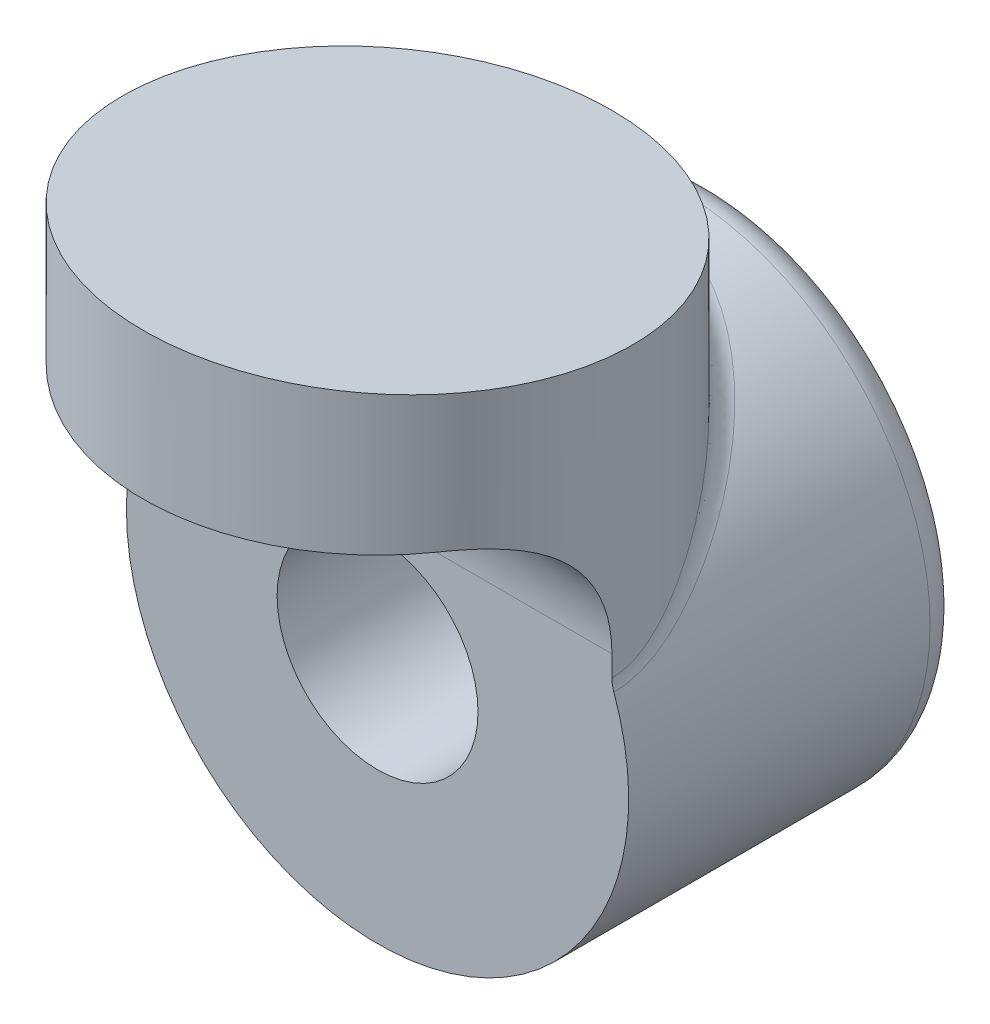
from build123d import *

# Parameters (mm, degrees)
ESQUISSE1_R             = 15
ESQUISSE1_R_2           = 6
EXTRUSION1_DEPTH        = 25
ESQUISSE2_W             = 14
ESQUISSE2_H             = 20
ESQUISSE3_W             = 40
ESQUISSE3_H             = 15
ENL_V_MAT_EXTRU_1_DEPTH = 20
ESQUISSE4_R             = 6
ENL_V_MAT_EXTRU_2_DEPTH = 39.405728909
CONG_1_R                = 8
CONG_2_R                = 2
ENL_V_MAT_EXTRU_3_DEPTH = 40
ESQUISSE6_R             = 15
ENL_V_MAT_EXTRU_4_DEPTH = 5
CONG_3_R                = 2


with BuildPart() as part:
    # Esquisse1 → Extrusion1 (new body)
    with BuildSketch(Plane.XY):
        Circle(ESQUISSE1_R)
        Circle(ESQUISSE1_R_2, mode=Mode.SUBTRACT)
    extrude(amount=EXTRUSION1_DEPTH)

    # Esquisse2 → R_volution1 (revolve)
    with BuildSketch(Plane.XY.offset(25), mode=Mode.PRIVATE) as r_volution1_sk:
        with Locations((7, 15)):
            Rectangle(ESQUISSE2_W, ESQUISSE2_H)
    revolve(r_volution1_sk.sketch.rotate(Axis((0, 0, 25), (0, 1, 0)), 90), axis=Axis((0, 0, 25), (0, 1, 0)))

    # Esquisse3 → Enl_v. mat.-Extru.1 (cut)
    with BuildSketch(Plane.XY.offset(25)):
        with Locations((0, 7.5)):
            Rectangle(ESQUISSE3_W, ESQUISSE3_H)
    extrude(amount=ENL_V_MAT_EXTRU_1_DEPTH, mode=Mode.SUBTRACT)

    # Esquisse4 → Enl_v. mat.-Extru.2 (cut, through all)
    with BuildSketch(Plane.XY.offset(25)):
        Circle(ESQUISSE4_R)
    extrude(amount=-ENL_V_MAT_EXTRU_2_DEPTH, mode=Mode.SUBTRACT)

    # Cong_1
    cong_1_edges = [part.edges().sort_by_distance(p)[0] for p in [
        (0, 15, 25),
    ]]
    fillet(cong_1_edges, radius=CONG_1_R)

    # Cong_2
    cong_2_edges = [part.edges().sort_by_distance(p)[0] for p in [
        (10.15174813, 11.042735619, 15.35935637),
    ]]
    fillet(cong_2_edges, radius=CONG_2_R)

    # Esquisse5 → Enl_v. mat.-Extru.3 (cut, symmetric)
    with BuildSketch(Plane(origin=(0, 0, 0), x_dir=(0, 0, -1), z_dir=(1, 0, 0))):
        Polygon((-42.204360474, 32.059194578), (-42.947519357, 24.093787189), (6.836276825, 19.449044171), (7.579435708, 27.41445156), align=None)
    extrude(amount=ENL_V_MAT_EXTRU_3_DEPTH, both=True, mode=Mode.SUBTRACT)

    # Esquisse6 → Enl_v. mat.-Extru.4 (cut)
    with BuildSketch(Plane(origin=(0, 0, 0), x_dir=(-1, 0, 0), z_dir=(0, 0, -1))):
        Circle(ESQUISSE6_R)
    extrude(amount=-ENL_V_MAT_EXTRU_4_DEPTH, mode=Mode.SUBTRACT)

    # Cong_3
    cong_3_edges = [part.edges().sort_by_distance(p)[0] for p in [
        (-15, 0, 5),
    ]]
    fillet(cong_3_edges, radius=CONG_3_R)


solid = part.part
